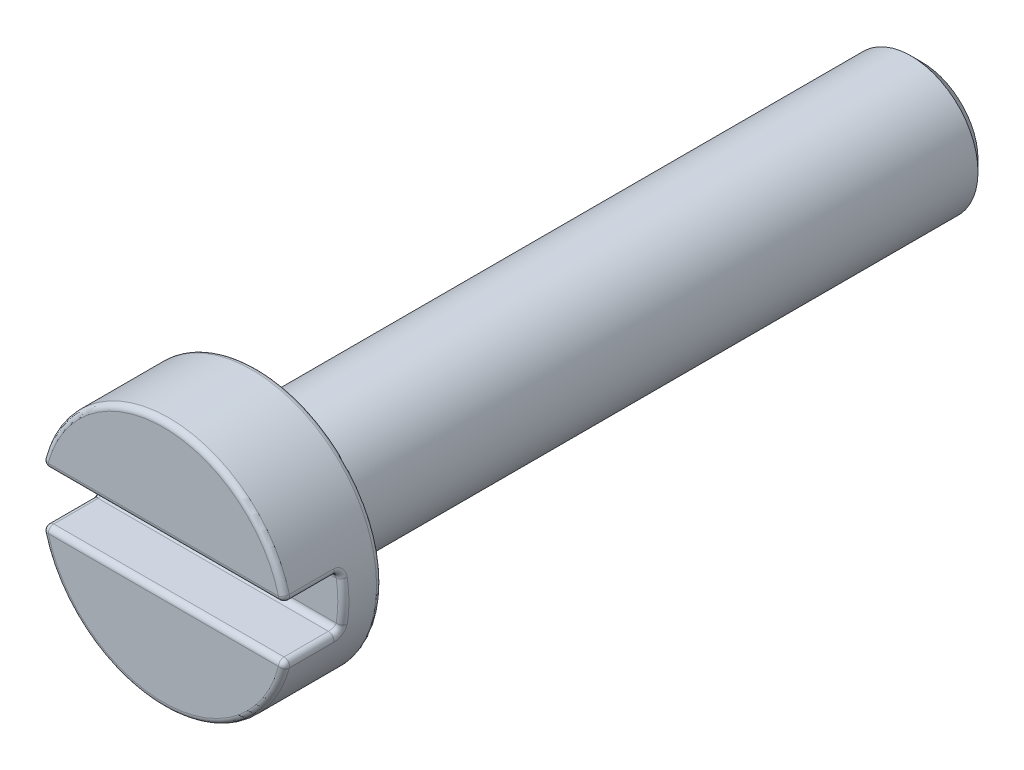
from build123d import *

# Parameters (mm, degrees)
SKIZZE2_W                       = 4.5
SKIZZE2_H                       = 0.9
SCHNITT_LINEAR_AUSTRAGEN1_DEPTH = 1
FASE1_SIZE                      = 0.2
VERRUNDUNG2_R                   = 0.1


with BuildPart() as part:
    # Skizze1 → Rotation1 (revolve)
    with BuildSketch(Plane(origin=(0, 0, 0), x_dir=(0, 0, -1), z_dir=(1, 0, 0)), mode=Mode.PRIVATE) as rotation1_sk:
        Polygon((-1.7, 0), (-1.7, 2.25), (0, 2.25), (0, 1.21), (12, 1.21), (12, 0), align=None)
    revolve(rotation1_sk.sketch.rotate(Axis((0, 0, 21.919879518), (0, 0, -1)), 90), axis=Axis((0, 0, 21.919879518), (0, 0, -1)))

    # Skizze2 → Schnitt-Linear austragen1 (cut)
    with BuildSketch(Plane.XY.offset(1.7)):
        Rectangle(SKIZZE2_W, SKIZZE2_H)
    extrude(amount=-SCHNITT_LINEAR_AUSTRAGEN1_DEPTH, mode=Mode.SUBTRACT)

    # Fase1
    fase1_edges = [part.edges().sort_by_distance(p)[0] for p in [
        (-1.21, 0, -12),
    ]]
    chamfer(fase1_edges, length=FASE1_SIZE)

    # Verrundung2
    verrundung2_edges = [part.edges().sort_by_distance(p)[0] for p in [
        (0, 2.25, 1.7),
        (0, -2.25, 1.7),
        (2.238606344, -0.226145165, 0.7),
        (2.204540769, 0.45, 1.2),
        (2.204540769, -0.45, 1.2),
        (-2.25, 0, 0.7),
        (-2.204540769, 0.45, 1.2),
        (-2.204540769, -0.45, 1.2),
        (0, -0.45, 0.7),
        (0, 0.45, 0.7),
        (0, 0.45, 1.7),
        (0, -0.45, 1.7),
        (-2.25, 0, 0),
    ]]
    fillet(verrundung2_edges, radius=VERRUNDUNG2_R)


solid = part.part
